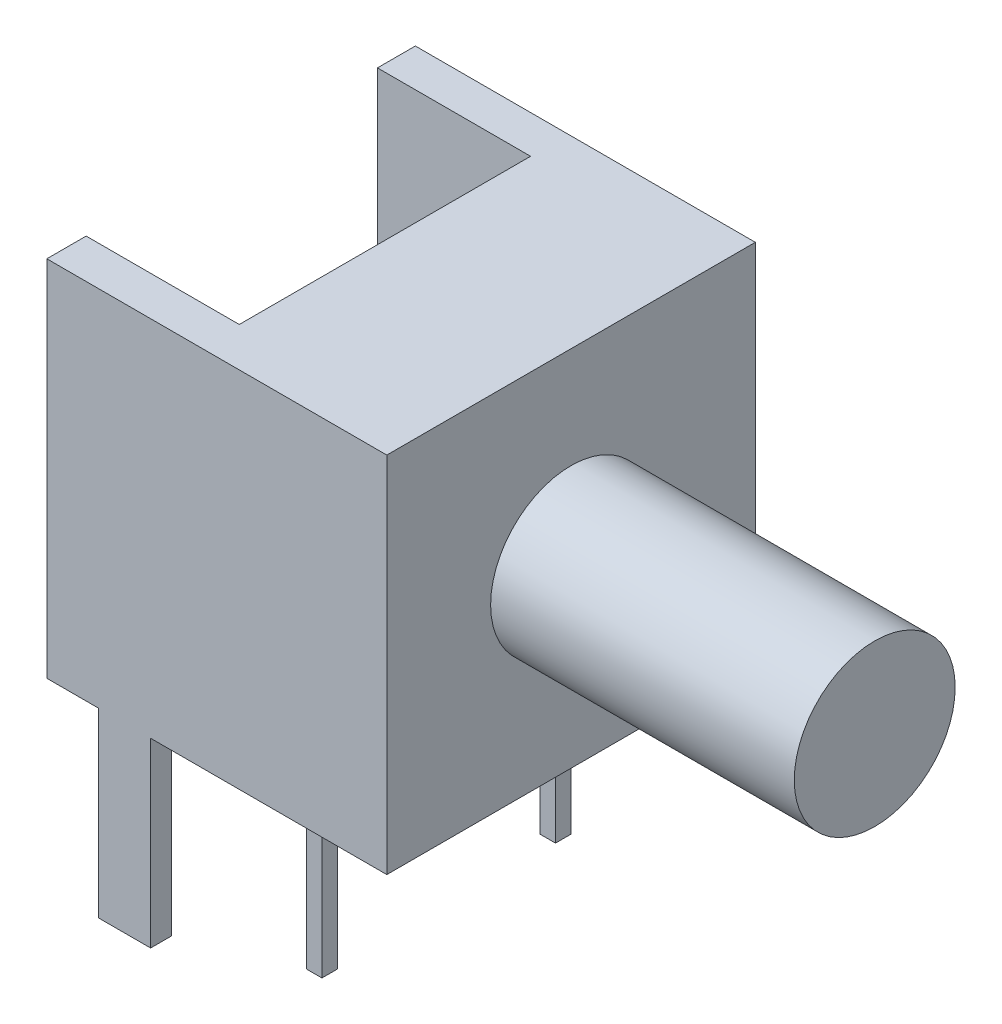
ISO-10303-21;
HEADER;
FILE_DESCRIPTION(('STEP AP214'),'2;1');
FILE_NAME('part.step','',(''),(''),'','','');
FILE_SCHEMA(('AUTOMOTIVE_DESIGN { 1 0 10303 214 1 1 1 1 }'));
ENDSEC;
DATA;
#1=APPLICATION_CONTEXT('core data for automotive mechanical design processes');
#2=APPLICATION_PROTOCOL_DEFINITION('international standard','automotive_design',2000,#1);
#3=PRODUCT_CONTEXT('',#1,'mechanical');
#4=PRODUCT('Part','Part','',(#3));
#5=PRODUCT_RELATED_PRODUCT_CATEGORY('part','',(#4));
#6=PRODUCT_DEFINITION_FORMATION('','',#4);
#7=PRODUCT_DEFINITION_CONTEXT('part definition',#1,'design');
#8=PRODUCT_DEFINITION('design','',#6,#7);
#9=PRODUCT_DEFINITION_SHAPE('','',#8);
#10=(LENGTH_UNIT() NAMED_UNIT(*) SI_UNIT(.MILLI.,.METRE.));
#11=(NAMED_UNIT(*) PLANE_ANGLE_UNIT() SI_UNIT($,.RADIAN.));
#12=(NAMED_UNIT(*) SI_UNIT($,.STERADIAN.) SOLID_ANGLE_UNIT());
#13=UNCERTAINTY_MEASURE_WITH_UNIT(LENGTH_MEASURE(1.E-05),#10,'distance_accuracy_value','');
#14=(GEOMETRIC_REPRESENTATION_CONTEXT(3) GLOBAL_UNCERTAINTY_ASSIGNED_CONTEXT((#13)) GLOBAL_UNIT_ASSIGNED_CONTEXT((#10,
#11,#12)) REPRESENTATION_CONTEXT('',''));
#15=CARTESIAN_POINT('',(0.,0.,0.));
#16=DIRECTION('',(0.,0.,1.));
#17=DIRECTION('',(1.,0.,0.));
#18=AXIS2_PLACEMENT_3D('',#15,#16,#17);
#19=CARTESIAN_POINT('',(0.,3.5,-3.55));
#20=DIRECTION('',(-1.,0.,0.));
#21=DIRECTION('',(0.,0.,1.));
#22=AXIS2_PLACEMENT_3D('',#19,#20,#21);
#23=PLANE('',#22);
#24=DIRECTION('',(0.,1.,0.));
#25=VECTOR('',#24,1.);
#26=CARTESIAN_POINT('',(0.,-3.5,-3.55));
#27=LINE('',#26,#25);
#28=CARTESIAN_POINT('',(0.,-3.5,-3.55));
#29=VERTEX_POINT('',#28);
#30=CARTESIAN_POINT('',(0.,3.5,-3.55));
#31=VERTEX_POINT('',#30);
#32=EDGE_CURVE('E229',#29,#31,#27,.T.);
#33=ORIENTED_EDGE('',*,*,#32,.T.);
#34=DIRECTION('',(0.,0.,1.));
#35=VECTOR('',#34,1.);
#36=CARTESIAN_POINT('',(0.,3.5,3.55));
#37=LINE('',#36,#35);
#38=CARTESIAN_POINT('',(0.,3.5,3.55));
#39=VERTEX_POINT('',#38);
#40=EDGE_CURVE('E232',#31,#39,#37,.T.);
#41=ORIENTED_EDGE('',*,*,#40,.T.);
#42=DIRECTION('',(0.,-1.,0.));
#43=VECTOR('',#42,1.);
#44=CARTESIAN_POINT('',(0.,-3.5,3.55));
#45=LINE('',#44,#43);
#46=CARTESIAN_POINT('',(0.,-3.5,3.55));
#47=VERTEX_POINT('',#46);
#48=EDGE_CURVE('E236',#39,#47,#45,.T.);
#49=ORIENTED_EDGE('',*,*,#48,.T.);
#50=DIRECTION('',(0.,0.,-1.));
#51=VECTOR('',#50,1.);
#52=CARTESIAN_POINT('',(0.,-3.5,3.55));
#53=LINE('',#52,#51);
#54=EDGE_CURVE('E220',#47,#29,#53,.T.);
#55=ORIENTED_EDGE('',*,*,#54,.T.);
#56=EDGE_LOOP('',(#33,#41,#49,#55));
#57=FACE_BOUND('',#56,.T.);
#58=CARTESIAN_POINT('',(0.,0.,0.));
#59=DIRECTION('',(-1.,0.,0.));
#60=DIRECTION('',(0.,0.,1.));
#61=AXIS2_PLACEMENT_3D('',#58,#59,#60);
#62=CIRCLE('',#61,1.55);
#63=CARTESIAN_POINT('',(0.,0.,1.55));
#64=VERTEX_POINT('',#63);
#65=EDGE_CURVE('E11',#64,#64,#62,.F.);
#66=ORIENTED_EDGE('',*,*,#65,.F.);
#67=EDGE_LOOP('',(#66));
#68=FACE_BOUND('',#67,.T.);
#69=ADVANCED_FACE('F31',(#57,#68),#23,.F.);
#70=CARTESIAN_POINT('',(-6.55,3.5,-3.55));
#71=DIRECTION('',(-1.,0.,0.));
#72=DIRECTION('',(0.,0.,1.));
#73=AXIS2_PLACEMENT_3D('',#70,#71,#72);
#74=PLANE('',#73);
#75=DIRECTION('',(0.,-1.,0.));
#76=VECTOR('',#75,1.);
#77=CARTESIAN_POINT('',(-6.55,3.5,-2.82011053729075));
#78=LINE('',#77,#76);
#79=CARTESIAN_POINT('',(-6.55,3.5,-2.82011053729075));
#80=VERTEX_POINT('',#79);
#81=CARTESIAN_POINT('',(-6.55,-3.5,-2.82011053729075));
#82=VERTEX_POINT('',#81);
#83=EDGE_CURVE('E39',#80,#82,#78,.T.);
#84=ORIENTED_EDGE('',*,*,#83,.F.);
#85=DIRECTION('',(0.,0.,1.));
#86=VECTOR('',#85,1.);
#87=CARTESIAN_POINT('',(-6.55,3.5,3.55));
#88=LINE('',#87,#86);
#89=CARTESIAN_POINT('',(-6.55,3.5,-3.55));
#90=VERTEX_POINT('',#89);
#91=EDGE_CURVE('E215',#90,#80,#88,.T.);
#92=ORIENTED_EDGE('',*,*,#91,.F.);
#93=DIRECTION('',(0.,1.,0.));
#94=VECTOR('',#93,1.);
#95=CARTESIAN_POINT('',(-6.55,-3.5,-3.55));
#96=LINE('',#95,#94);
#97=CARTESIAN_POINT('',(-6.55,-3.5,-3.55));
#98=VERTEX_POINT('',#97);
#99=EDGE_CURVE('E216',#98,#90,#96,.T.);
#100=ORIENTED_EDGE('',*,*,#99,.F.);
#101=DIRECTION('',(0.,0.,-1.));
#102=VECTOR('',#101,1.);
#103=CARTESIAN_POINT('',(-6.55,-3.5,3.55));
#104=LINE('',#103,#102);
#105=EDGE_CURVE('E225',#82,#98,#104,.T.);
#106=ORIENTED_EDGE('',*,*,#105,.F.);
#107=EDGE_LOOP('',(#84,#92,#100,#106));
#108=FACE_BOUND('',#107,.T.);
#109=ADVANCED_FACE('F279',(#108),#74,.T.);
#110=CARTESIAN_POINT('',(-6.55,-3.5,3.55));
#111=DIRECTION('',(0.,-1.,0.));
#112=DIRECTION('',(0.,0.,-1.));
#113=AXIS2_PLACEMENT_3D('',#110,#111,#112);
#114=PLANE('',#113);
#115=DIRECTION('',(1.,0.,0.));
#116=VECTOR('',#115,1.);
#117=CARTESIAN_POINT('',(-6.55,-3.5,-2.82011053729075));
#118=LINE('',#117,#116);
#119=CARTESIAN_POINT('',(-3.6,-3.5,-2.82011053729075));
#120=VERTEX_POINT('',#119);
#121=EDGE_CURVE('E400',#82,#120,#118,.T.);
#122=ORIENTED_EDGE('',*,*,#121,.F.);
#123=ORIENTED_EDGE('',*,*,#105,.T.);
#124=DIRECTION('',(1.,0.,0.));
#125=VECTOR('',#124,1.);
#126=CARTESIAN_POINT('',(-6.55,-3.5,-3.55));
#127=LINE('',#126,#125);
#128=CARTESIAN_POINT('',(-5.55,-3.5,-3.55));
#129=VERTEX_POINT('',#128);
#130=EDGE_CURVE('E200',#98,#129,#127,.T.);
#131=ORIENTED_EDGE('',*,*,#130,.T.);
#132=DIRECTION('',(0.,0.,1.));
#133=VECTOR('',#132,1.);
#134=CARTESIAN_POINT('',(-5.55,-3.5,-3.15));
#135=LINE('',#134,#133);
#136=CARTESIAN_POINT('',(-5.55,-3.5,-3.15));
#137=VERTEX_POINT('',#136);
#138=EDGE_CURVE('E438',#129,#137,#135,.T.);
#139=ORIENTED_EDGE('',*,*,#138,.T.);
#140=DIRECTION('',(1.,0.,0.));
#141=VECTOR('',#140,1.);
#142=CARTESIAN_POINT('',(-5.55,-3.5,-3.15));
#143=LINE('',#142,#141);
#144=CARTESIAN_POINT('',(-4.55,-3.5,-3.15));
#145=VERTEX_POINT('',#144);
#146=EDGE_CURVE('E449',#137,#145,#143,.T.);
#147=ORIENTED_EDGE('',*,*,#146,.T.);
#148=DIRECTION('',(0.,0.,-1.));
#149=VECTOR('',#148,1.);
#150=CARTESIAN_POINT('',(-4.55,-3.5,-3.15));
#151=LINE('',#150,#149);
#152=CARTESIAN_POINT('',(-4.55,-3.5,-3.55));
#153=VERTEX_POINT('',#152);
#154=EDGE_CURVE('E271',#145,#153,#151,.T.);
#155=ORIENTED_EDGE('',*,*,#154,.T.);
#156=EDGE_CURVE('E242',#153,#29,#127,.T.);
#157=ORIENTED_EDGE('',*,*,#156,.T.);
#158=ORIENTED_EDGE('',*,*,#54,.F.);
#159=DIRECTION('',(1.,0.,0.));
#160=VECTOR('',#159,1.);
#161=CARTESIAN_POINT('',(-6.55,-3.5,3.55));
#162=LINE('',#161,#160);
#163=CARTESIAN_POINT('',(-4.55,-3.5,3.55));
#164=VERTEX_POINT('',#163);
#165=EDGE_CURVE('E249',#164,#47,#162,.T.);
#166=ORIENTED_EDGE('',*,*,#165,.F.);
#167=DIRECTION('',(0.,0.,1.));
#168=VECTOR('',#167,1.);
#169=CARTESIAN_POINT('',(-4.55,-3.5,3.15));
#170=LINE('',#169,#168);
#171=CARTESIAN_POINT('',(-4.55,-3.5,3.15));
#172=VERTEX_POINT('',#171);
#173=EDGE_CURVE('E491',#172,#164,#170,.T.);
#174=ORIENTED_EDGE('',*,*,#173,.F.);
#175=DIRECTION('',(1.,0.,0.));
#176=VECTOR('',#175,1.);
#177=CARTESIAN_POINT('',(-5.55,-3.5,3.15));
#178=LINE('',#177,#176);
#179=CARTESIAN_POINT('',(-5.55,-3.5,3.15));
#180=VERTEX_POINT('',#179);
#181=EDGE_CURVE('E496',#180,#172,#178,.T.);
#182=ORIENTED_EDGE('',*,*,#181,.F.);
#183=DIRECTION('',(0.,0.,-1.));
#184=VECTOR('',#183,1.);
#185=CARTESIAN_POINT('',(-5.55,-3.5,3.15));
#186=LINE('',#185,#184);
#187=CARTESIAN_POINT('',(-5.55,-3.5,3.55));
#188=VERTEX_POINT('',#187);
#189=EDGE_CURVE('E508',#188,#180,#186,.T.);
#190=ORIENTED_EDGE('',*,*,#189,.F.);
#191=CARTESIAN_POINT('',(-6.55,-3.5,3.55));
#192=VERTEX_POINT('',#191);
#193=EDGE_CURVE('E252',#192,#188,#162,.T.);
#194=ORIENTED_EDGE('',*,*,#193,.F.);
#195=CARTESIAN_POINT('',(-6.55,-3.5,2.79237595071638));
#196=VERTEX_POINT('',#195);
#197=EDGE_CURVE('E226',#192,#196,#104,.T.);
#198=ORIENTED_EDGE('',*,*,#197,.T.);
#199=DIRECTION('',(-1.,0.,0.));
#200=VECTOR('',#199,1.);
#201=CARTESIAN_POINT('',(-6.55,-3.5,2.79237595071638));
#202=LINE('',#201,#200);
#203=CARTESIAN_POINT('',(-3.6,-3.5,2.79237595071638));
#204=VERTEX_POINT('',#203);
#205=EDGE_CURVE('E46',#204,#196,#202,.T.);
#206=ORIENTED_EDGE('',*,*,#205,.F.);
#207=DIRECTION('',(0.,0.,1.));
#208=VECTOR('',#207,1.);
#209=CARTESIAN_POINT('',(-3.6,-3.5,3.55));
#210=LINE('',#209,#208);
#211=EDGE_CURVE('E402',#120,#204,#210,.T.);
#212=ORIENTED_EDGE('',*,*,#211,.F.);
#213=EDGE_LOOP('',(#122,#123,#131,#139,#147,#155,#157,#158,#166,#174,#182,#190,#194,#198,#206,#212));
#214=FACE_BOUND('',#213,.T.);
#215=DIRECTION('',(0.,0.,-1.));
#216=VECTOR('',#215,1.);
#217=CARTESIAN_POINT('',(-2.4,-3.5,-2.4));
#218=LINE('',#217,#216);
#219=CARTESIAN_POINT('',(-2.4,-3.5,-2.1));
#220=VERTEX_POINT('',#219);
#221=CARTESIAN_POINT('',(-2.4,-3.5,-2.4));
#222=VERTEX_POINT('',#221);
#223=EDGE_CURVE('E404',#220,#222,#218,.T.);
#224=ORIENTED_EDGE('',*,*,#223,.T.);
#225=DIRECTION('',(-1.,0.,0.));
#226=VECTOR('',#225,1.);
#227=CARTESIAN_POINT('',(-2.7,-3.5,-2.4));
#228=LINE('',#227,#226);
#229=CARTESIAN_POINT('',(-2.7,-3.5,-2.4));
#230=VERTEX_POINT('',#229);
#231=EDGE_CURVE('E409',#222,#230,#228,.T.);
#232=ORIENTED_EDGE('',*,*,#231,.T.);
#233=DIRECTION('',(0.,0.,1.));
#234=VECTOR('',#233,1.);
#235=CARTESIAN_POINT('',(-2.7,-3.5,-2.4));
#236=LINE('',#235,#234);
#237=CARTESIAN_POINT('',(-2.7,-3.5,-2.1));
#238=VERTEX_POINT('',#237);
#239=EDGE_CURVE('E421',#230,#238,#236,.T.);
#240=ORIENTED_EDGE('',*,*,#239,.T.);
#241=DIRECTION('',(1.,0.,0.));
#242=VECTOR('',#241,1.);
#243=CARTESIAN_POINT('',(-2.7,-3.5,-2.1));
#244=LINE('',#243,#242);
#245=EDGE_CURVE('E54',#238,#220,#244,.T.);
#246=ORIENTED_EDGE('',*,*,#245,.T.);
#247=EDGE_LOOP('',(#224,#232,#240,#246));
#248=FACE_BOUND('',#247,.T.);
#249=DIRECTION('',(-1.,0.,0.));
#250=VECTOR('',#249,1.);
#251=CARTESIAN_POINT('',(-2.7,-3.5,2.4));
#252=LINE('',#251,#250);
#253=CARTESIAN_POINT('',(-2.4,-3.5,2.4));
#254=VERTEX_POINT('',#253);
#255=CARTESIAN_POINT('',(-2.7,-3.5,2.4));
#256=VERTEX_POINT('',#255);
#257=EDGE_CURVE('E476',#254,#256,#252,.T.);
#258=ORIENTED_EDGE('',*,*,#257,.F.);
#259=DIRECTION('',(0.,0.,1.));
#260=VECTOR('',#259,1.);
#261=CARTESIAN_POINT('',(-2.4,-3.5,2.4));
#262=LINE('',#261,#260);
#263=CARTESIAN_POINT('',(-2.4,-3.5,2.1));
#264=VERTEX_POINT('',#263);
#265=EDGE_CURVE('E462',#264,#254,#262,.T.);
#266=ORIENTED_EDGE('',*,*,#265,.F.);
#267=DIRECTION('',(1.,0.,0.));
#268=VECTOR('',#267,1.);
#269=CARTESIAN_POINT('',(-2.7,-3.5,2.1));
#270=LINE('',#269,#268);
#271=CARTESIAN_POINT('',(-2.7,-3.5,2.1));
#272=VERTEX_POINT('',#271);
#273=EDGE_CURVE('E467',#272,#264,#270,.T.);
#274=ORIENTED_EDGE('',*,*,#273,.F.);
#275=DIRECTION('',(0.,0.,-1.));
#276=VECTOR('',#275,1.);
#277=CARTESIAN_POINT('',(-2.7,-3.5,2.4));
#278=LINE('',#277,#276);
#279=EDGE_CURVE('E478',#256,#272,#278,.T.);
#280=ORIENTED_EDGE('',*,*,#279,.F.);
#281=EDGE_LOOP('',(#258,#266,#274,#280));
#282=FACE_BOUND('',#281,.T.);
#283=ADVANCED_FACE('F268',(#214,#248,#282),#114,.T.);
#284=CARTESIAN_POINT('',(-6.55,-3.5,-3.55));
#285=DIRECTION('',(0.,0.,-1.));
#286=DIRECTION('',(-1.,0.,0.));
#287=AXIS2_PLACEMENT_3D('',#284,#285,#286);
#288=PLANE('',#287);
#289=ORIENTED_EDGE('',*,*,#32,.F.);
#290=ORIENTED_EDGE('',*,*,#156,.F.);
#291=DIRECTION('',(0.,1.,0.));
#292=VECTOR('',#291,1.);
#293=CARTESIAN_POINT('',(-4.55,-7.,-3.55));
#294=LINE('',#293,#292);
#295=CARTESIAN_POINT('',(-4.55,-7.,-3.55));
#296=VERTEX_POINT('',#295);
#297=EDGE_CURVE('E447',#296,#153,#294,.T.);
#298=ORIENTED_EDGE('',*,*,#297,.F.);
#299=DIRECTION('',(-1.,0.,0.));
#300=VECTOR('',#299,1.);
#301=CARTESIAN_POINT('',(-5.55,-7.,-3.55));
#302=LINE('',#301,#300);
#303=CARTESIAN_POINT('',(-5.55,-7.,-3.55));
#304=VERTEX_POINT('',#303);
#305=EDGE_CURVE('E444',#296,#304,#302,.T.);
#306=ORIENTED_EDGE('',*,*,#305,.T.);
#307=DIRECTION('',(0.,1.,0.));
#308=VECTOR('',#307,1.);
#309=CARTESIAN_POINT('',(-5.55,-7.,-3.55));
#310=LINE('',#309,#308);
#311=EDGE_CURVE('E453',#304,#129,#310,.T.);
#312=ORIENTED_EDGE('',*,*,#311,.T.);
#313=ORIENTED_EDGE('',*,*,#130,.F.);
#314=ORIENTED_EDGE('',*,*,#99,.T.);
#315=DIRECTION('',(1.,0.,0.));
#316=VECTOR('',#315,1.);
#317=CARTESIAN_POINT('',(-6.55,3.5,-3.55));
#318=LINE('',#317,#316);
#319=EDGE_CURVE('E228',#90,#31,#318,.T.);
#320=ORIENTED_EDGE('',*,*,#319,.T.);
#321=EDGE_LOOP('',(#289,#290,#298,#306,#312,#313,#314,#320));
#322=FACE_BOUND('',#321,.T.);
#323=ADVANCED_FACE('F33',(#322),#288,.T.);
#324=CARTESIAN_POINT('',(-6.55,-3.5,3.55));
#325=DIRECTION('',(0.,0.,1.));
#326=DIRECTION('',(1.,0.,0.));
#327=AXIS2_PLACEMENT_3D('',#324,#325,#326);
#328=PLANE('',#327);
#329=ORIENTED_EDGE('',*,*,#48,.F.);
#330=DIRECTION('',(1.,0.,0.));
#331=VECTOR('',#330,1.);
#332=CARTESIAN_POINT('',(-6.55,3.5,3.55));
#333=LINE('',#332,#331);
#334=CARTESIAN_POINT('',(-6.55,3.5,3.55));
#335=VERTEX_POINT('',#334);
#336=EDGE_CURVE('E245',#335,#39,#333,.T.);
#337=ORIENTED_EDGE('',*,*,#336,.F.);
#338=DIRECTION('',(0.,-1.,0.));
#339=VECTOR('',#338,1.);
#340=CARTESIAN_POINT('',(-6.55,-3.5,3.55));
#341=LINE('',#340,#339);
#342=EDGE_CURVE('E214',#335,#192,#341,.T.);
#343=ORIENTED_EDGE('',*,*,#342,.T.);
#344=ORIENTED_EDGE('',*,*,#193,.T.);
#345=DIRECTION('',(0.,1.,0.));
#346=VECTOR('',#345,1.);
#347=CARTESIAN_POINT('',(-5.55,-7.,3.55));
#348=LINE('',#347,#346);
#349=CARTESIAN_POINT('',(-5.55,-7.,3.55));
#350=VERTEX_POINT('',#349);
#351=EDGE_CURVE('E527',#350,#188,#348,.T.);
#352=ORIENTED_EDGE('',*,*,#351,.F.);
#353=DIRECTION('',(-1.,0.,0.));
#354=VECTOR('',#353,1.);
#355=CARTESIAN_POINT('',(-5.55,-7.,3.55));
#356=LINE('',#355,#354);
#357=CARTESIAN_POINT('',(-4.55,-7.,3.55));
#358=VERTEX_POINT('',#357);
#359=EDGE_CURVE('E495',#358,#350,#356,.T.);
#360=ORIENTED_EDGE('',*,*,#359,.F.);
#361=DIRECTION('',(0.,1.,0.));
#362=VECTOR('',#361,1.);
#363=CARTESIAN_POINT('',(-4.55,-7.,3.55));
#364=LINE('',#363,#362);
#365=EDGE_CURVE('E233',#358,#164,#364,.T.);
#366=ORIENTED_EDGE('',*,*,#365,.T.);
#367=ORIENTED_EDGE('',*,*,#165,.T.);
#368=EDGE_LOOP('',(#329,#337,#343,#344,#352,#360,#366,#367));
#369=FACE_BOUND('',#368,.T.);
#370=ADVANCED_FACE('F260',(#369),#328,.T.);
#371=CARTESIAN_POINT('',(-6.55,3.5,3.55));
#372=DIRECTION('',(0.,1.,0.));
#373=DIRECTION('',(0.,0.,1.));
#374=AXIS2_PLACEMENT_3D('',#371,#372,#373);
#375=PLANE('',#374);
#376=DIRECTION('',(-1.,0.,0.));
#377=VECTOR('',#376,1.);
#378=CARTESIAN_POINT('',(-6.55,3.5,-2.82011053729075));
#379=LINE('',#378,#377);
#380=CARTESIAN_POINT('',(-3.6,3.5,-2.82011053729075));
#381=VERTEX_POINT('',#380);
#382=EDGE_CURVE('E393',#381,#80,#379,.T.);
#383=ORIENTED_EDGE('',*,*,#382,.F.);
#384=DIRECTION('',(0.,0.,-1.));
#385=VECTOR('',#384,1.);
#386=CARTESIAN_POINT('',(-3.6,3.5,-2.82011053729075));
#387=LINE('',#386,#385);
#388=CARTESIAN_POINT('',(-3.6,3.5,2.79237595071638));
#389=VERTEX_POINT('',#388);
#390=EDGE_CURVE('E208',#389,#381,#387,.T.);
#391=ORIENTED_EDGE('',*,*,#390,.F.);
#392=DIRECTION('',(1.,0.,0.));
#393=VECTOR('',#392,1.);
#394=CARTESIAN_POINT('',(-6.55,3.5,2.79237595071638));
#395=LINE('',#394,#393);
#396=CARTESIAN_POINT('',(-6.55,3.5,2.79237595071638));
#397=VERTEX_POINT('',#396);
#398=EDGE_CURVE('E194',#397,#389,#395,.T.);
#399=ORIENTED_EDGE('',*,*,#398,.F.);
#400=EDGE_CURVE('E205',#397,#335,#88,.T.);
#401=ORIENTED_EDGE('',*,*,#400,.T.);
#402=ORIENTED_EDGE('',*,*,#336,.T.);
#403=ORIENTED_EDGE('',*,*,#40,.F.);
#404=ORIENTED_EDGE('',*,*,#319,.F.);
#405=ORIENTED_EDGE('',*,*,#91,.T.);
#406=EDGE_LOOP('',(#383,#391,#399,#401,#402,#403,#404,#405));
#407=FACE_BOUND('',#406,.T.);
#408=ADVANCED_FACE('F204',(#407),#375,.T.);
#409=DIRECTION('',(0.,1.,0.));
#410=VECTOR('',#409,1.);
#411=CARTESIAN_POINT('',(-6.55,3.5,2.79237595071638));
#412=LINE('',#411,#410);
#413=EDGE_CURVE('E191',#196,#397,#412,.T.);
#414=ORIENTED_EDGE('',*,*,#413,.F.);
#415=ORIENTED_EDGE('',*,*,#197,.F.);
#416=ORIENTED_EDGE('',*,*,#342,.F.);
#417=ORIENTED_EDGE('',*,*,#400,.F.);
#418=EDGE_LOOP('',(#414,#415,#416,#417));
#419=FACE_BOUND('',#418,.T.);
#420=ADVANCED_FACE('F212',(#419),#74,.T.);
#421=CARTESIAN_POINT('',(-4.55,-7.,3.15));
#422=DIRECTION('',(-1.,0.,0.));
#423=DIRECTION('',(0.,0.,1.));
#424=AXIS2_PLACEMENT_3D('',#421,#422,#423);
#425=PLANE('',#424);
#426=ORIENTED_EDGE('',*,*,#173,.T.);
#427=ORIENTED_EDGE('',*,*,#365,.F.);
#428=DIRECTION('',(0.,0.,1.));
#429=VECTOR('',#428,1.);
#430=CARTESIAN_POINT('',(-4.55,-7.,3.15));
#431=LINE('',#430,#429);
#432=CARTESIAN_POINT('',(-4.55,-7.,3.15));
#433=VERTEX_POINT('',#432);
#434=EDGE_CURVE('E492',#433,#358,#431,.T.);
#435=ORIENTED_EDGE('',*,*,#434,.F.);
#436=DIRECTION('',(0.,1.,0.));
#437=VECTOR('',#436,1.);
#438=CARTESIAN_POINT('',(-4.55,-7.,3.15));
#439=LINE('',#438,#437);
#440=EDGE_CURVE('E502',#433,#172,#439,.T.);
#441=ORIENTED_EDGE('',*,*,#440,.T.);
#442=EDGE_LOOP('',(#426,#427,#435,#441));
#443=FACE_BOUND('',#442,.T.);
#444=ADVANCED_FACE('F293',(#443),#425,.F.);
#445=CARTESIAN_POINT('',(-5.55,-7.,3.15));
#446=DIRECTION('',(1.,0.,0.));
#447=DIRECTION('',(0.,0.,-1.));
#448=AXIS2_PLACEMENT_3D('',#445,#446,#447);
#449=PLANE('',#448);
#450=ORIENTED_EDGE('',*,*,#189,.T.);
#451=DIRECTION('',(0.,1.,0.));
#452=VECTOR('',#451,1.);
#453=CARTESIAN_POINT('',(-5.55,-7.,3.15));
#454=LINE('',#453,#452);
#455=CARTESIAN_POINT('',(-5.55,-7.,3.15));
#456=VERTEX_POINT('',#455);
#457=EDGE_CURVE('E531',#456,#180,#454,.T.);
#458=ORIENTED_EDGE('',*,*,#457,.F.);
#459=DIRECTION('',(0.,0.,-1.));
#460=VECTOR('',#459,1.);
#461=CARTESIAN_POINT('',(-5.55,-7.,3.15));
#462=LINE('',#461,#460);
#463=EDGE_CURVE('E498',#350,#456,#462,.T.);
#464=ORIENTED_EDGE('',*,*,#463,.F.);
#465=ORIENTED_EDGE('',*,*,#351,.T.);
#466=EDGE_LOOP('',(#450,#458,#464,#465));
#467=FACE_BOUND('',#466,.T.);
#468=ADVANCED_FACE('F297',(#467),#449,.F.);
#469=CARTESIAN_POINT('',(-5.55,-7.,3.15));
#470=DIRECTION('',(0.,0.,1.));
#471=DIRECTION('',(1.,0.,0.));
#472=AXIS2_PLACEMENT_3D('',#469,#470,#471);
#473=PLANE('',#472);
#474=ORIENTED_EDGE('',*,*,#181,.T.);
#475=ORIENTED_EDGE('',*,*,#440,.F.);
#476=DIRECTION('',(1.,0.,0.));
#477=VECTOR('',#476,1.);
#478=CARTESIAN_POINT('',(-5.55,-7.,3.15));
#479=LINE('',#478,#477);
#480=EDGE_CURVE('E500',#456,#433,#479,.T.);
#481=ORIENTED_EDGE('',*,*,#480,.F.);
#482=ORIENTED_EDGE('',*,*,#457,.T.);
#483=EDGE_LOOP('',(#474,#475,#481,#482));
#484=FACE_BOUND('',#483,.T.);
#485=ADVANCED_FACE('F302',(#484),#473,.F.);
#486=CARTESIAN_POINT('',(-4.55,-7.,3.55));
#487=DIRECTION('',(0.,1.,0.));
#488=DIRECTION('',(0.,0.,1.));
#489=AXIS2_PLACEMENT_3D('',#486,#487,#488);
#490=PLANE('',#489);
#491=ORIENTED_EDGE('',*,*,#434,.T.);
#492=ORIENTED_EDGE('',*,*,#359,.T.);
#493=ORIENTED_EDGE('',*,*,#463,.T.);
#494=ORIENTED_EDGE('',*,*,#480,.T.);
#495=EDGE_LOOP('',(#491,#492,#493,#494));
#496=FACE_BOUND('',#495,.T.);
#497=ADVANCED_FACE('F308',(#496),#490,.F.);
#498=CARTESIAN_POINT('',(-2.4,-7.,2.4));
#499=DIRECTION('',(-1.,0.,0.));
#500=DIRECTION('',(0.,0.,1.));
#501=AXIS2_PLACEMENT_3D('',#498,#499,#500);
#502=PLANE('',#501);
#503=ORIENTED_EDGE('',*,*,#265,.T.);
#504=DIRECTION('',(0.,1.,0.));
#505=VECTOR('',#504,1.);
#506=CARTESIAN_POINT('',(-2.4,-7.,2.4));
#507=LINE('',#506,#505);
#508=CARTESIAN_POINT('',(-2.4,-7.,2.4));
#509=VERTEX_POINT('',#508);
#510=EDGE_CURVE('E489',#509,#254,#507,.T.);
#511=ORIENTED_EDGE('',*,*,#510,.F.);
#512=DIRECTION('',(0.,0.,1.));
#513=VECTOR('',#512,1.);
#514=CARTESIAN_POINT('',(-2.4,-7.,2.4));
#515=LINE('',#514,#513);
#516=CARTESIAN_POINT('',(-2.4,-7.,2.1));
#517=VERTEX_POINT('',#516);
#518=EDGE_CURVE('E463',#517,#509,#515,.T.);
#519=ORIENTED_EDGE('',*,*,#518,.F.);
#520=DIRECTION('',(0.,1.,0.));
#521=VECTOR('',#520,1.);
#522=CARTESIAN_POINT('',(-2.4,-7.,2.1));
#523=LINE('',#522,#521);
#524=EDGE_CURVE('E473',#517,#264,#523,.T.);
#525=ORIENTED_EDGE('',*,*,#524,.T.);
#526=EDGE_LOOP('',(#503,#511,#519,#525));
#527=FACE_BOUND('',#526,.T.);
#528=ADVANCED_FACE('F312',(#527),#502,.F.);
#529=CARTESIAN_POINT('',(-2.7,-7.,2.4));
#530=DIRECTION('',(0.,0.,-1.));
#531=DIRECTION('',(-1.,0.,0.));
#532=AXIS2_PLACEMENT_3D('',#529,#530,#531);
#533=PLANE('',#532);
#534=ORIENTED_EDGE('',*,*,#257,.T.);
#535=DIRECTION('',(0.,1.,0.));
#536=VECTOR('',#535,1.);
#537=CARTESIAN_POINT('',(-2.7,-7.,2.4));
#538=LINE('',#537,#536);
#539=CARTESIAN_POINT('',(-2.7,-7.,2.4));
#540=VERTEX_POINT('',#539);
#541=EDGE_CURVE('E486',#540,#256,#538,.T.);
#542=ORIENTED_EDGE('',*,*,#541,.F.);
#543=DIRECTION('',(-1.,0.,0.));
#544=VECTOR('',#543,1.);
#545=CARTESIAN_POINT('',(-2.7,-7.,2.4));
#546=LINE('',#545,#544);
#547=EDGE_CURVE('E466',#509,#540,#546,.T.);
#548=ORIENTED_EDGE('',*,*,#547,.F.);
#549=ORIENTED_EDGE('',*,*,#510,.T.);
#550=EDGE_LOOP('',(#534,#542,#548,#549));
#551=FACE_BOUND('',#550,.T.);
#552=ADVANCED_FACE('F316',(#551),#533,.F.);
#553=CARTESIAN_POINT('',(-2.7,-7.,2.4));
#554=DIRECTION('',(1.,0.,0.));
#555=DIRECTION('',(0.,0.,-1.));
#556=AXIS2_PLACEMENT_3D('',#553,#554,#555);
#557=PLANE('',#556);
#558=ORIENTED_EDGE('',*,*,#279,.T.);
#559=DIRECTION('',(0.,1.,0.));
#560=VECTOR('',#559,1.);
#561=CARTESIAN_POINT('',(-2.7,-7.,2.1));
#562=LINE('',#561,#560);
#563=CARTESIAN_POINT('',(-2.7,-7.,2.1));
#564=VERTEX_POINT('',#563);
#565=EDGE_CURVE('E484',#564,#272,#562,.T.);
#566=ORIENTED_EDGE('',*,*,#565,.F.);
#567=DIRECTION('',(0.,0.,-1.));
#568=VECTOR('',#567,1.);
#569=CARTESIAN_POINT('',(-2.7,-7.,2.4));
#570=LINE('',#569,#568);
#571=EDGE_CURVE('E469',#540,#564,#570,.T.);
#572=ORIENTED_EDGE('',*,*,#571,.F.);
#573=ORIENTED_EDGE('',*,*,#541,.T.);
#574=EDGE_LOOP('',(#558,#566,#572,#573));
#575=FACE_BOUND('',#574,.T.);
#576=ADVANCED_FACE('F320',(#575),#557,.F.);
#577=CARTESIAN_POINT('',(-2.7,-7.,2.1));
#578=DIRECTION('',(0.,0.,1.));
#579=DIRECTION('',(1.,0.,0.));
#580=AXIS2_PLACEMENT_3D('',#577,#578,#579);
#581=PLANE('',#580);
#582=ORIENTED_EDGE('',*,*,#273,.T.);
#583=ORIENTED_EDGE('',*,*,#524,.F.);
#584=DIRECTION('',(1.,0.,0.));
#585=VECTOR('',#584,1.);
#586=CARTESIAN_POINT('',(-2.7,-7.,2.1));
#587=LINE('',#586,#585);
#588=EDGE_CURVE('E471',#564,#517,#587,.T.);
#589=ORIENTED_EDGE('',*,*,#588,.F.);
#590=ORIENTED_EDGE('',*,*,#565,.T.);
#591=EDGE_LOOP('',(#582,#583,#589,#590));
#592=FACE_BOUND('',#591,.T.);
#593=ADVANCED_FACE('F324',(#592),#581,.F.);
#594=CARTESIAN_POINT('',(-2.4,-7.,2.1));
#595=DIRECTION('',(0.,-1.,0.));
#596=DIRECTION('',(0.,0.,-1.));
#597=AXIS2_PLACEMENT_3D('',#594,#595,#596);
#598=PLANE('',#597);
#599=ORIENTED_EDGE('',*,*,#518,.T.);
#600=ORIENTED_EDGE('',*,*,#547,.T.);
#601=ORIENTED_EDGE('',*,*,#571,.T.);
#602=ORIENTED_EDGE('',*,*,#588,.T.);
#603=EDGE_LOOP('',(#599,#600,#601,#602));
#604=FACE_BOUND('',#603,.T.);
#605=ADVANCED_FACE('F328',(#604),#598,.T.);
#606=CARTESIAN_POINT('',(-4.55,-7.,-3.15));
#607=DIRECTION('',(1.,0.,0.));
#608=DIRECTION('',(0.,0.,-1.));
#609=AXIS2_PLACEMENT_3D('',#606,#607,#608);
#610=PLANE('',#609);
#611=ORIENTED_EDGE('',*,*,#154,.F.);
#612=DIRECTION('',(0.,1.,0.));
#613=VECTOR('',#612,1.);
#614=CARTESIAN_POINT('',(-4.55,-7.,-3.15));
#615=LINE('',#614,#613);
#616=CARTESIAN_POINT('',(-4.55,-7.,-3.15));
#617=VERTEX_POINT('',#616);
#618=EDGE_CURVE('E459',#617,#145,#615,.T.);
#619=ORIENTED_EDGE('',*,*,#618,.F.);
#620=DIRECTION('',(0.,0.,-1.));
#621=VECTOR('',#620,1.);
#622=CARTESIAN_POINT('',(-4.55,-7.,-3.15));
#623=LINE('',#622,#621);
#624=EDGE_CURVE('E434',#617,#296,#623,.T.);
#625=ORIENTED_EDGE('',*,*,#624,.T.);
#626=ORIENTED_EDGE('',*,*,#297,.T.);
#627=EDGE_LOOP('',(#611,#619,#625,#626));
#628=FACE_BOUND('',#627,.T.);
#629=ADVANCED_FACE('F332',(#628),#610,.T.);
#630=CARTESIAN_POINT('',(-5.55,-7.,-3.15));
#631=DIRECTION('',(0.,0.,1.));
#632=DIRECTION('',(1.,0.,0.));
#633=AXIS2_PLACEMENT_3D('',#630,#631,#632);
#634=PLANE('',#633);
#635=ORIENTED_EDGE('',*,*,#146,.F.);
#636=DIRECTION('',(0.,1.,0.));
#637=VECTOR('',#636,1.);
#638=CARTESIAN_POINT('',(-5.55,-7.,-3.15));
#639=LINE('',#638,#637);
#640=CARTESIAN_POINT('',(-5.55,-7.,-3.15));
#641=VERTEX_POINT('',#640);
#642=EDGE_CURVE('E456',#641,#137,#639,.T.);
#643=ORIENTED_EDGE('',*,*,#642,.F.);
#644=DIRECTION('',(1.,0.,0.));
#645=VECTOR('',#644,1.);
#646=CARTESIAN_POINT('',(-5.55,-7.,-3.15));
#647=LINE('',#646,#645);
#648=EDGE_CURVE('E437',#641,#617,#647,.T.);
#649=ORIENTED_EDGE('',*,*,#648,.T.);
#650=ORIENTED_EDGE('',*,*,#618,.T.);
#651=EDGE_LOOP('',(#635,#643,#649,#650));
#652=FACE_BOUND('',#651,.T.);
#653=ADVANCED_FACE('F336',(#652),#634,.T.);
#654=CARTESIAN_POINT('',(-5.55,-7.,-3.15));
#655=DIRECTION('',(-1.,0.,0.));
#656=DIRECTION('',(0.,0.,1.));
#657=AXIS2_PLACEMENT_3D('',#654,#655,#656);
#658=PLANE('',#657);
#659=ORIENTED_EDGE('',*,*,#138,.F.);
#660=ORIENTED_EDGE('',*,*,#311,.F.);
#661=DIRECTION('',(0.,0.,1.));
#662=VECTOR('',#661,1.);
#663=CARTESIAN_POINT('',(-5.55,-7.,-3.15));
#664=LINE('',#663,#662);
#665=EDGE_CURVE('E441',#304,#641,#664,.T.);
#666=ORIENTED_EDGE('',*,*,#665,.T.);
#667=ORIENTED_EDGE('',*,*,#642,.T.);
#668=EDGE_LOOP('',(#659,#660,#666,#667));
#669=FACE_BOUND('',#668,.T.);
#670=ADVANCED_FACE('F340',(#669),#658,.T.);
#671=CARTESIAN_POINT('',(-4.55,-7.,-3.55));
#672=DIRECTION('',(0.,1.,0.));
#673=DIRECTION('',(0.,0.,-1.));
#674=AXIS2_PLACEMENT_3D('',#671,#672,#673);
#675=PLANE('',#674);
#676=ORIENTED_EDGE('',*,*,#624,.F.);
#677=ORIENTED_EDGE('',*,*,#648,.F.);
#678=ORIENTED_EDGE('',*,*,#665,.F.);
#679=ORIENTED_EDGE('',*,*,#305,.F.);
#680=EDGE_LOOP('',(#676,#677,#678,#679));
#681=FACE_BOUND('',#680,.T.);
#682=ADVANCED_FACE('F344',(#681),#675,.F.);
#683=CARTESIAN_POINT('',(-2.4,-7.,-2.4));
#684=DIRECTION('',(1.,0.,0.));
#685=DIRECTION('',(0.,0.,-1.));
#686=AXIS2_PLACEMENT_3D('',#683,#684,#685);
#687=PLANE('',#686);
#688=ORIENTED_EDGE('',*,*,#223,.F.);
#689=DIRECTION('',(0.,1.,0.));
#690=VECTOR('',#689,1.);
#691=CARTESIAN_POINT('',(-2.4,-7.,-2.1));
#692=LINE('',#691,#690);
#693=CARTESIAN_POINT('',(-2.4,-7.,-2.1));
#694=VERTEX_POINT('',#693);
#695=EDGE_CURVE('E432',#694,#220,#692,.T.);
#696=ORIENTED_EDGE('',*,*,#695,.F.);
#697=DIRECTION('',(0.,0.,-1.));
#698=VECTOR('',#697,1.);
#699=CARTESIAN_POINT('',(-2.4,-7.,-2.4));
#700=LINE('',#699,#698);
#701=CARTESIAN_POINT('',(-2.4,-7.,-2.4));
#702=VERTEX_POINT('',#701);
#703=EDGE_CURVE('E405',#694,#702,#700,.T.);
#704=ORIENTED_EDGE('',*,*,#703,.T.);
#705=DIRECTION('',(0.,1.,0.));
#706=VECTOR('',#705,1.);
#707=CARTESIAN_POINT('',(-2.4,-7.,-2.4));
#708=LINE('',#707,#706);
#709=EDGE_CURVE('E418',#702,#222,#708,.T.);
#710=ORIENTED_EDGE('',*,*,#709,.T.);
#711=EDGE_LOOP('',(#688,#696,#704,#710));
#712=FACE_BOUND('',#711,.T.);
#713=ADVANCED_FACE('F348',(#712),#687,.T.);
#714=CARTESIAN_POINT('',(-2.7,-7.,-2.1));
#715=DIRECTION('',(0.,0.,1.));
#716=DIRECTION('',(1.,0.,0.));
#717=AXIS2_PLACEMENT_3D('',#714,#715,#716);
#718=PLANE('',#717);
#719=ORIENTED_EDGE('',*,*,#245,.F.);
#720=DIRECTION('',(0.,1.,0.));
#721=VECTOR('',#720,1.);
#722=CARTESIAN_POINT('',(-2.7,-7.,-2.1));
#723=LINE('',#722,#721);
#724=CARTESIAN_POINT('',(-2.7,-7.,-2.1));
#725=VERTEX_POINT('',#724);
#726=EDGE_CURVE('E429',#725,#238,#723,.T.);
#727=ORIENTED_EDGE('',*,*,#726,.F.);
#728=DIRECTION('',(1.,0.,0.));
#729=VECTOR('',#728,1.);
#730=CARTESIAN_POINT('',(-2.7,-7.,-2.1));
#731=LINE('',#730,#729);
#732=EDGE_CURVE('E408',#725,#694,#731,.T.);
#733=ORIENTED_EDGE('',*,*,#732,.T.);
#734=ORIENTED_EDGE('',*,*,#695,.T.);
#735=EDGE_LOOP('',(#719,#727,#733,#734));
#736=FACE_BOUND('',#735,.T.);
#737=ADVANCED_FACE('F352',(#736),#718,.T.);
#738=CARTESIAN_POINT('',(-2.7,-7.,-2.4));
#739=DIRECTION('',(-1.,0.,0.));
#740=DIRECTION('',(0.,0.,1.));
#741=AXIS2_PLACEMENT_3D('',#738,#739,#740);
#742=PLANE('',#741);
#743=ORIENTED_EDGE('',*,*,#239,.F.);
#744=DIRECTION('',(0.,1.,0.));
#745=VECTOR('',#744,1.);
#746=CARTESIAN_POINT('',(-2.7,-7.,-2.4));
#747=LINE('',#746,#745);
#748=CARTESIAN_POINT('',(-2.7,-7.,-2.4));
#749=VERTEX_POINT('',#748);
#750=EDGE_CURVE('E426',#749,#230,#747,.T.);
#751=ORIENTED_EDGE('',*,*,#750,.F.);
#752=DIRECTION('',(0.,0.,1.));
#753=VECTOR('',#752,1.);
#754=CARTESIAN_POINT('',(-2.7,-7.,-2.4));
#755=LINE('',#754,#753);
#756=EDGE_CURVE('E412',#749,#725,#755,.T.);
#757=ORIENTED_EDGE('',*,*,#756,.T.);
#758=ORIENTED_EDGE('',*,*,#726,.T.);
#759=EDGE_LOOP('',(#743,#751,#757,#758));
#760=FACE_BOUND('',#759,.T.);
#761=ADVANCED_FACE('F356',(#760),#742,.T.);
#762=CARTESIAN_POINT('',(-2.7,-7.,-2.4));
#763=DIRECTION('',(0.,0.,-1.));
#764=DIRECTION('',(-1.,0.,0.));
#765=AXIS2_PLACEMENT_3D('',#762,#763,#764);
#766=PLANE('',#765);
#767=ORIENTED_EDGE('',*,*,#231,.F.);
#768=ORIENTED_EDGE('',*,*,#709,.F.);
#769=DIRECTION('',(-1.,0.,0.));
#770=VECTOR('',#769,1.);
#771=CARTESIAN_POINT('',(-2.7,-7.,-2.4));
#772=LINE('',#771,#770);
#773=EDGE_CURVE('E415',#702,#749,#772,.T.);
#774=ORIENTED_EDGE('',*,*,#773,.T.);
#775=ORIENTED_EDGE('',*,*,#750,.T.);
#776=EDGE_LOOP('',(#767,#768,#774,#775));
#777=FACE_BOUND('',#776,.T.);
#778=ADVANCED_FACE('F360',(#777),#766,.T.);
#779=CARTESIAN_POINT('',(-2.4,-7.,-2.1));
#780=DIRECTION('',(0.,-1.,0.));
#781=DIRECTION('',(0.,0.,1.));
#782=AXIS2_PLACEMENT_3D('',#779,#780,#781);
#783=PLANE('',#782);
#784=ORIENTED_EDGE('',*,*,#703,.F.);
#785=ORIENTED_EDGE('',*,*,#732,.F.);
#786=ORIENTED_EDGE('',*,*,#756,.F.);
#787=ORIENTED_EDGE('',*,*,#773,.F.);
#788=EDGE_LOOP('',(#784,#785,#786,#787));
#789=FACE_BOUND('',#788,.T.);
#790=ADVANCED_FACE('F364',(#789),#783,.T.);
#791=CARTESIAN_POINT('',(-6.55,-7.000025,-2.82011053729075));
#792=DIRECTION('',(0.,0.,-1.));
#793=DIRECTION('',(-1.,0.,0.));
#794=AXIS2_PLACEMENT_3D('',#791,#792,#793);
#795=PLANE('',#794);
#796=ORIENTED_EDGE('',*,*,#121,.T.);
#797=DIRECTION('',(0.,1.,0.));
#798=VECTOR('',#797,1.);
#799=CARTESIAN_POINT('',(-3.6,-7.000025,-2.82011053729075));
#800=LINE('',#799,#798);
#801=EDGE_CURVE('E396',#120,#381,#800,.T.);
#802=ORIENTED_EDGE('',*,*,#801,.T.);
#803=ORIENTED_EDGE('',*,*,#382,.T.);
#804=ORIENTED_EDGE('',*,*,#83,.T.);
#805=EDGE_LOOP('',(#796,#802,#803,#804));
#806=FACE_BOUND('',#805,.T.);
#807=ADVANCED_FACE('F368',(#806),#795,.F.);
#808=CARTESIAN_POINT('',(-3.6,-7.000025,-2.82011053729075));
#809=DIRECTION('',(1.,0.,0.));
#810=DIRECTION('',(0.,0.,-1.));
#811=AXIS2_PLACEMENT_3D('',#808,#809,#810);
#812=PLANE('',#811);
#813=ORIENTED_EDGE('',*,*,#211,.T.);
#814=DIRECTION('',(0.,1.,0.));
#815=VECTOR('',#814,1.);
#816=CARTESIAN_POINT('',(-3.6,-7.000025,2.79237595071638));
#817=LINE('',#816,#815);
#818=EDGE_CURVE('E395',#204,#389,#817,.T.);
#819=ORIENTED_EDGE('',*,*,#818,.T.);
#820=ORIENTED_EDGE('',*,*,#390,.T.);
#821=ORIENTED_EDGE('',*,*,#801,.F.);
#822=EDGE_LOOP('',(#813,#819,#820,#821));
#823=FACE_BOUND('',#822,.T.);
#824=ADVANCED_FACE('F373',(#823),#812,.F.);
#825=CARTESIAN_POINT('',(-6.55,-7.000025,2.79237595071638));
#826=DIRECTION('',(0.,0.,1.));
#827=DIRECTION('',(1.,0.,0.));
#828=AXIS2_PLACEMENT_3D('',#825,#826,#827);
#829=PLANE('',#828);
#830=ORIENTED_EDGE('',*,*,#205,.T.);
#831=ORIENTED_EDGE('',*,*,#413,.T.);
#832=ORIENTED_EDGE('',*,*,#398,.T.);
#833=ORIENTED_EDGE('',*,*,#818,.F.);
#834=EDGE_LOOP('',(#830,#831,#832,#833));
#835=FACE_BOUND('',#834,.T.);
#836=ADVANCED_FACE('F193',(#835),#829,.F.);
#837=CARTESIAN_POINT('',(5.85,0.,0.));
#838=DIRECTION('',(-1.,0.,0.));
#839=DIRECTION('',(0.,0.,1.));
#840=AXIS2_PLACEMENT_3D('',#837,#838,#839);
#841=CYLINDRICAL_SURFACE('',#840,1.55);
#842=CARTESIAN_POINT('',(5.85,0.,0.));
#843=DIRECTION('',(1.,0.,0.));
#844=DIRECTION('',(0.,0.,-1.));
#845=AXIS2_PLACEMENT_3D('',#842,#843,#844);
#846=CIRCLE('',#845,1.55);
#847=CARTESIAN_POINT('',(5.85,0.,-1.55));
#848=VERTEX_POINT('',#847);
#849=EDGE_CURVE('E209',#848,#848,#846,.T.);
#850=ORIENTED_EDGE('',*,*,#849,.F.);
#851=EDGE_LOOP('',(#850));
#852=FACE_BOUND('',#851,.T.);
#853=ORIENTED_EDGE('',*,*,#65,.T.);
#854=EDGE_LOOP('',(#853));
#855=FACE_BOUND('',#854,.T.);
#856=ADVANCED_FACE('F372',(#852,#855),#841,.T.);
#857=CARTESIAN_POINT('',(5.85,0.,0.));
#858=DIRECTION('',(1.,0.,0.));
#859=DIRECTION('',(0.,0.,-1.));
#860=AXIS2_PLACEMENT_3D('',#857,#858,#859);
#861=PLANE('',#860);
#862=ORIENTED_EDGE('',*,*,#849,.T.);
#863=EDGE_LOOP('',(#862));
#864=FACE_BOUND('',#863,.T.);
#865=ADVANCED_FACE('F382',(#864),#861,.T.);
#866=CLOSED_SHELL('',(#69,#109,#283,#323,#370,#408,#420,#444,#468,#485,#497,#528,#552,#576,#593,
#605,#629,#653,#670,#682,#713,#737,#761,#778,#790,#807,#824,#836,#856,#865));
#867=MANIFOLD_SOLID_BREP('B2',#866);
#868=ADVANCED_BREP_SHAPE_REPRESENTATION('',(#18,#867),#14);
#869=SHAPE_DEFINITION_REPRESENTATION(#9,#868);
ENDSEC;
END-ISO-10303-21;
